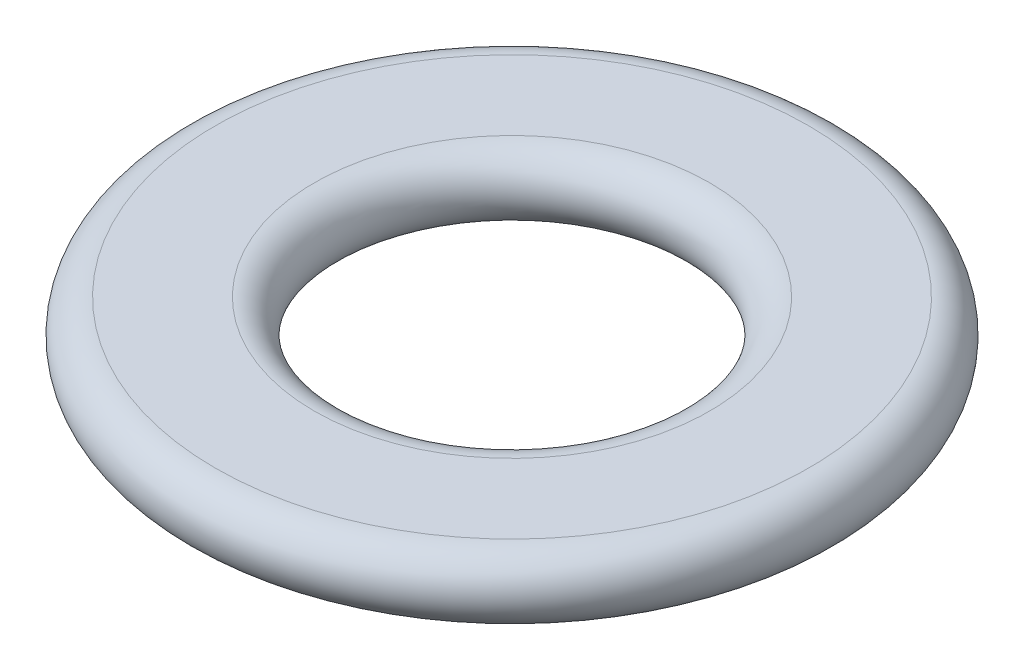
from build123d import *


with BuildPart() as part:
    # Esquisse1 → Base (revolve)
    with BuildSketch(Plane.XY, mode=Mode.PRIVATE) as base_sk:
        with BuildLine():
            Line((3, 0.5), (4.5, 0.5))
            ThreePointArc((4.5, 0.5), (5, 0), (4.5, -0.5))
            Line((4.5, -0.5), (3, -0.5))
            ThreePointArc((3, -0.5), (2.5, 0), (3, 0.5))
        make_face()
    revolve(base_sk.sketch.rotate(Axis((0, 0, 0), (0, 1, 0)), 90), axis=Axis((0, 0, 0), (0, 1, 0)))


solid = part.part
